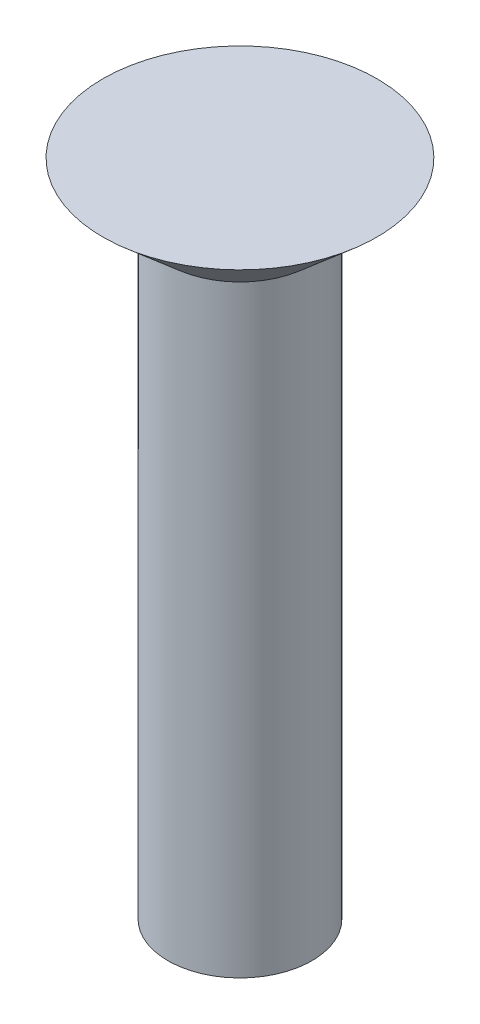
from build123d import *


with BuildPart() as part:
    # Sketch1 → Revolve1 (revolve)
    with BuildSketch(Plane.XY, mode=Mode.PRIVATE) as revolve1_sk:
        Polygon((0, 0), (3.9624, 0), (2.0828, -1.633911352), (2.0828, -19.05), (0, -19.05), align=None)
    revolve(revolve1_sk.sketch.rotate(Axis((0, 0, 0), (0, -1, 0)), 180), axis=Axis((0, 0, 0), (0, -1, 0)))


solid = part.part
